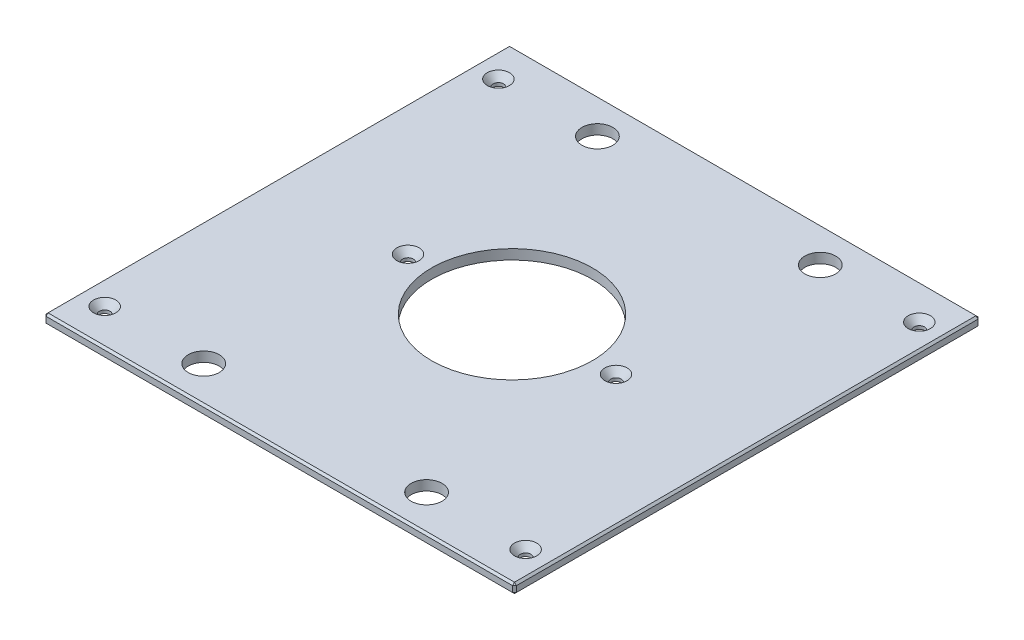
ISO-10303-21;
HEADER;
FILE_DESCRIPTION(('STEP AP214'),'2;1');
FILE_NAME('part.step','',(''),(''),'','','');
FILE_SCHEMA(('AUTOMOTIVE_DESIGN { 1 0 10303 214 1 1 1 1 }'));
ENDSEC;
DATA;
#1=APPLICATION_CONTEXT('core data for automotive mechanical design processes');
#2=APPLICATION_PROTOCOL_DEFINITION('international standard','automotive_design',2000,#1);
#3=PRODUCT_CONTEXT('',#1,'mechanical');
#4=PRODUCT('Part','Part','',(#3));
#5=PRODUCT_RELATED_PRODUCT_CATEGORY('part','',(#4));
#6=PRODUCT_DEFINITION_FORMATION('','',#4);
#7=PRODUCT_DEFINITION_CONTEXT('part definition',#1,'design');
#8=PRODUCT_DEFINITION('design','',#6,#7);
#9=PRODUCT_DEFINITION_SHAPE('','',#8);
#10=(LENGTH_UNIT() NAMED_UNIT(*) SI_UNIT(.MILLI.,.METRE.));
#11=(NAMED_UNIT(*) PLANE_ANGLE_UNIT() SI_UNIT($,.RADIAN.));
#12=(NAMED_UNIT(*) SI_UNIT($,.STERADIAN.) SOLID_ANGLE_UNIT());
#13=UNCERTAINTY_MEASURE_WITH_UNIT(LENGTH_MEASURE(1.E-05),#10,'distance_accuracy_value','');
#14=(GEOMETRIC_REPRESENTATION_CONTEXT(3) GLOBAL_UNCERTAINTY_ASSIGNED_CONTEXT((#13)) GLOBAL_UNIT_ASSIGNED_CONTEXT((#10,
#11,#12)) REPRESENTATION_CONTEXT('',''));
#15=CARTESIAN_POINT('',(0.,0.,0.));
#16=DIRECTION('',(0.,0.,1.));
#17=DIRECTION('',(1.,0.,0.));
#18=AXIS2_PLACEMENT_3D('',#15,#16,#17);
#19=CARTESIAN_POINT('',(-150.8125,6.35,-149.225));
#20=DIRECTION('',(1.,0.,0.));
#21=DIRECTION('',(0.,0.,-1.));
#22=AXIS2_PLACEMENT_3D('',#19,#20,#21);
#23=PLANE('',#22);
#24=DIRECTION('',(0.,0.,-1.));
#25=VECTOR('',#24,1.);
#26=CARTESIAN_POINT('',(-150.8125,5.08000000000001,-149.225));
#27=LINE('',#26,#25);
#28=CARTESIAN_POINT('',(-150.8125,5.08000000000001,147.955));
#29=VERTEX_POINT('',#28);
#30=CARTESIAN_POINT('',(-150.8125,5.08000000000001,-147.955));
#31=VERTEX_POINT('',#30);
#32=EDGE_CURVE('E135',#29,#31,#27,.T.);
#33=ORIENTED_EDGE('',*,*,#32,.T.);
#34=DIRECTION('',(0.,-1.,0.));
#35=VECTOR('',#34,1.);
#36=CARTESIAN_POINT('',(-150.8125,6.35,-147.955));
#37=LINE('',#36,#35);
#38=CARTESIAN_POINT('',(-150.8125,1.26999999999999,-147.955));
#39=VERTEX_POINT('',#38);
#40=EDGE_CURVE('E131',#31,#39,#37,.T.);
#41=ORIENTED_EDGE('',*,*,#40,.T.);
#42=DIRECTION('',(0.,0.,1.));
#43=VECTOR('',#42,1.);
#44=CARTESIAN_POINT('',(-150.8125,1.26999999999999,-149.225));
#45=LINE('',#44,#43);
#46=CARTESIAN_POINT('',(-150.8125,1.26999999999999,147.955));
#47=VERTEX_POINT('',#46);
#48=EDGE_CURVE('E126',#39,#47,#45,.T.);
#49=ORIENTED_EDGE('',*,*,#48,.T.);
#50=DIRECTION('',(0.,1.,0.));
#51=VECTOR('',#50,1.);
#52=CARTESIAN_POINT('',(-150.8125,6.35,147.955));
#53=LINE('',#52,#51);
#54=EDGE_CURVE('E128',#47,#29,#53,.T.);
#55=ORIENTED_EDGE('',*,*,#54,.T.);
#56=EDGE_LOOP('',(#33,#41,#49,#55));
#57=FACE_BOUND('',#56,.T.);
#58=ADVANCED_FACE('F35',(#57),#23,.F.);
#59=CARTESIAN_POINT('',(-150.8125,6.35,149.225));
#60=DIRECTION('',(0.,0.,-1.));
#61=DIRECTION('',(-1.,0.,0.));
#62=AXIS2_PLACEMENT_3D('',#59,#60,#61);
#63=PLANE('',#62);
#64=DIRECTION('',(1.,0.,0.));
#65=VECTOR('',#64,1.);
#66=CARTESIAN_POINT('',(-150.8125,1.26999999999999,149.225));
#67=LINE('',#66,#65);
#68=CARTESIAN_POINT('',(-149.5425,1.26999999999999,149.225));
#69=VERTEX_POINT('',#68);
#70=CARTESIAN_POINT('',(149.5425,1.26999999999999,149.225));
#71=VERTEX_POINT('',#70);
#72=EDGE_CURVE('E58',#69,#71,#67,.T.);
#73=ORIENTED_EDGE('',*,*,#72,.T.);
#74=DIRECTION('',(0.,1.,0.));
#75=VECTOR('',#74,1.);
#76=CARTESIAN_POINT('',(149.5425,6.35,149.225));
#77=LINE('',#76,#75);
#78=CARTESIAN_POINT('',(149.5425,5.08000000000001,149.225));
#79=VERTEX_POINT('',#78);
#80=EDGE_CURVE('E11',#71,#79,#77,.T.);
#81=ORIENTED_EDGE('',*,*,#80,.T.);
#82=DIRECTION('',(-1.,0.,0.));
#83=VECTOR('',#82,1.);
#84=CARTESIAN_POINT('',(-150.8125,5.08000000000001,149.225));
#85=LINE('',#84,#83);
#86=CARTESIAN_POINT('',(-149.5425,5.08000000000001,149.225));
#87=VERTEX_POINT('',#86);
#88=EDGE_CURVE('E44',#79,#87,#85,.T.);
#89=ORIENTED_EDGE('',*,*,#88,.T.);
#90=DIRECTION('',(0.,-1.,0.));
#91=VECTOR('',#90,1.);
#92=CARTESIAN_POINT('',(-149.5425,6.35,149.225));
#93=LINE('',#92,#91);
#94=EDGE_CURVE('E279',#87,#69,#93,.T.);
#95=ORIENTED_EDGE('',*,*,#94,.T.);
#96=EDGE_LOOP('',(#73,#81,#89,#95));
#97=FACE_BOUND('',#96,.T.);
#98=ADVANCED_FACE('F348',(#97),#63,.F.);
#99=CARTESIAN_POINT('',(150.8125,6.35,-149.225));
#100=DIRECTION('',(-1.,0.,0.));
#101=DIRECTION('',(0.,0.,1.));
#102=AXIS2_PLACEMENT_3D('',#99,#100,#101);
#103=PLANE('',#102);
#104=DIRECTION('',(0.,0.,-1.));
#105=VECTOR('',#104,1.);
#106=CARTESIAN_POINT('',(150.8125,1.26999999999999,-149.225));
#107=LINE('',#106,#105);
#108=CARTESIAN_POINT('',(150.8125,1.26999999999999,147.955));
#109=VERTEX_POINT('',#108);
#110=CARTESIAN_POINT('',(150.8125,1.26999999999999,-147.955));
#111=VERTEX_POINT('',#110);
#112=EDGE_CURVE('E274',#109,#111,#107,.T.);
#113=ORIENTED_EDGE('',*,*,#112,.T.);
#114=DIRECTION('',(0.,1.,0.));
#115=VECTOR('',#114,1.);
#116=CARTESIAN_POINT('',(150.8125,6.35,-147.955));
#117=LINE('',#116,#115);
#118=CARTESIAN_POINT('',(150.8125,5.08000000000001,-147.955));
#119=VERTEX_POINT('',#118);
#120=EDGE_CURVE('E276',#111,#119,#117,.T.);
#121=ORIENTED_EDGE('',*,*,#120,.T.);
#122=DIRECTION('',(0.,0.,1.));
#123=VECTOR('',#122,1.);
#124=CARTESIAN_POINT('',(150.8125,5.08000000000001,149.225));
#125=LINE('',#124,#123);
#126=CARTESIAN_POINT('',(150.8125,5.08000000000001,147.955));
#127=VERTEX_POINT('',#126);
#128=EDGE_CURVE('E272',#119,#127,#125,.T.);
#129=ORIENTED_EDGE('',*,*,#128,.T.);
#130=DIRECTION('',(0.,-1.,0.));
#131=VECTOR('',#130,1.);
#132=CARTESIAN_POINT('',(150.8125,6.35,147.955));
#133=LINE('',#132,#131);
#134=EDGE_CURVE('E270',#127,#109,#133,.T.);
#135=ORIENTED_EDGE('',*,*,#134,.T.);
#136=EDGE_LOOP('',(#113,#121,#129,#135));
#137=FACE_BOUND('',#136,.T.);
#138=ADVANCED_FACE('F335',(#137),#103,.F.);
#139=CARTESIAN_POINT('',(-150.8125,6.35,-149.225));
#140=DIRECTION('',(0.,0.,1.));
#141=DIRECTION('',(1.,0.,0.));
#142=AXIS2_PLACEMENT_3D('',#139,#140,#141);
#143=PLANE('',#142);
#144=DIRECTION('',(-1.,0.,0.));
#145=VECTOR('',#144,1.);
#146=CARTESIAN_POINT('',(-150.8125,1.26999999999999,-149.225));
#147=LINE('',#146,#145);
#148=CARTESIAN_POINT('',(149.5425,1.26999999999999,-149.225));
#149=VERTEX_POINT('',#148);
#150=CARTESIAN_POINT('',(-149.5425,1.26999999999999,-149.225));
#151=VERTEX_POINT('',#150);
#152=EDGE_CURVE('E246',#149,#151,#147,.T.);
#153=ORIENTED_EDGE('',*,*,#152,.T.);
#154=DIRECTION('',(0.,1.,0.));
#155=VECTOR('',#154,1.);
#156=CARTESIAN_POINT('',(-149.5425,6.35,-149.225));
#157=LINE('',#156,#155);
#158=CARTESIAN_POINT('',(-149.5425,5.08000000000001,-149.225));
#159=VERTEX_POINT('',#158);
#160=EDGE_CURVE('E250',#151,#159,#157,.T.);
#161=ORIENTED_EDGE('',*,*,#160,.T.);
#162=DIRECTION('',(1.,0.,0.));
#163=VECTOR('',#162,1.);
#164=CARTESIAN_POINT('',(150.8125,5.08000000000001,-149.225));
#165=LINE('',#164,#163);
#166=CARTESIAN_POINT('',(149.5425,5.08000000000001,-149.225));
#167=VERTEX_POINT('',#166);
#168=EDGE_CURVE('E248',#159,#167,#165,.T.);
#169=ORIENTED_EDGE('',*,*,#168,.T.);
#170=DIRECTION('',(0.,-1.,0.));
#171=VECTOR('',#170,1.);
#172=CARTESIAN_POINT('',(149.5425,6.35,-149.225));
#173=LINE('',#172,#171);
#174=EDGE_CURVE('E244',#167,#149,#173,.T.);
#175=ORIENTED_EDGE('',*,*,#174,.T.);
#176=EDGE_LOOP('',(#153,#161,#169,#175));
#177=FACE_BOUND('',#176,.T.);
#178=ADVANCED_FACE('F309',(#177),#143,.F.);
#179=CARTESIAN_POINT('',(0.,6.35,0.));
#180=DIRECTION('',(0.,1.,0.));
#181=DIRECTION('',(0.,0.,1.));
#182=AXIS2_PLACEMENT_3D('',#179,#180,#181);
#183=PLANE('',#182);
#184=CARTESIAN_POINT('',(134.9375,6.35,-126.20498));
#185=DIRECTION('',(0.,1.,0.));
#186=DIRECTION('',(0.,0.,1.));
#187=AXIS2_PLACEMENT_3D('',#184,#185,#186);
#188=CIRCLE('',#187,7.13739999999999);
#189=CARTESIAN_POINT('',(134.9375,6.35,-119.06758));
#190=VERTEX_POINT('',#189);
#191=EDGE_CURVE('E752',#190,#190,#188,.T.);
#192=ORIENTED_EDGE('',*,*,#191,.F.);
#193=EDGE_LOOP('',(#192));
#194=FACE_BOUND('',#193,.T.);
#195=CARTESIAN_POINT('',(134.9375,6.35,126.20498));
#196=DIRECTION('',(0.,1.,0.));
#197=DIRECTION('',(0.,0.,1.));
#198=AXIS2_PLACEMENT_3D('',#195,#196,#197);
#199=CIRCLE('',#198,7.13739999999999);
#200=CARTESIAN_POINT('',(134.9375,6.35,133.34238));
#201=VERTEX_POINT('',#200);
#202=EDGE_CURVE('E756',#201,#201,#199,.T.);
#203=ORIENTED_EDGE('',*,*,#202,.F.);
#204=EDGE_LOOP('',(#203));
#205=FACE_BOUND('',#204,.T.);
#206=CARTESIAN_POINT('',(-134.9375,6.35,126.20498));
#207=DIRECTION('',(0.,1.,0.));
#208=DIRECTION('',(0.,0.,1.));
#209=AXIS2_PLACEMENT_3D('',#206,#207,#208);
#210=CIRCLE('',#209,7.13739999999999);
#211=CARTESIAN_POINT('',(-134.9375,6.35,133.34238));
#212=VERTEX_POINT('',#211);
#213=EDGE_CURVE('E760',#212,#212,#210,.T.);
#214=ORIENTED_EDGE('',*,*,#213,.F.);
#215=EDGE_LOOP('',(#214));
#216=FACE_BOUND('',#215,.T.);
#217=CARTESIAN_POINT('',(-66.675,6.35,0.));
#218=DIRECTION('',(0.,1.,0.));
#219=DIRECTION('',(0.,0.,1.));
#220=AXIS2_PLACEMENT_3D('',#217,#218,#219);
#221=CIRCLE('',#220,7.1374);
#222=CARTESIAN_POINT('',(-66.675,6.35,7.1374));
#223=VERTEX_POINT('',#222);
#224=EDGE_CURVE('E764',#223,#223,#221,.T.);
#225=ORIENTED_EDGE('',*,*,#224,.F.);
#226=EDGE_LOOP('',(#225));
#227=FACE_BOUND('',#226,.T.);
#228=CARTESIAN_POINT('',(66.675,6.35,0.));
#229=DIRECTION('',(0.,1.,0.));
#230=DIRECTION('',(0.,0.,1.));
#231=AXIS2_PLACEMENT_3D('',#228,#229,#230);
#232=CIRCLE('',#231,7.1374);
#233=CARTESIAN_POINT('',(66.675,6.35,7.1374));
#234=VERTEX_POINT('',#233);
#235=EDGE_CURVE('E768',#234,#234,#232,.T.);
#236=ORIENTED_EDGE('',*,*,#235,.F.);
#237=EDGE_LOOP('',(#236));
#238=FACE_BOUND('',#237,.T.);
#239=CARTESIAN_POINT('',(-134.9375,6.35,-126.20498));
#240=DIRECTION('',(0.,1.,0.));
#241=DIRECTION('',(0.,0.,1.));
#242=AXIS2_PLACEMENT_3D('',#239,#240,#241);
#243=CIRCLE('',#242,7.13739999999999);
#244=CARTESIAN_POINT('',(-134.9375,6.35,-119.06758));
#245=VERTEX_POINT('',#244);
#246=EDGE_CURVE('E771',#245,#245,#243,.T.);
#247=ORIENTED_EDGE('',*,*,#246,.F.);
#248=EDGE_LOOP('',(#247));
#249=FACE_BOUND('',#248,.T.);
#250=DIRECTION('',(0.,0.,-1.));
#251=VECTOR('',#250,1.);
#252=CARTESIAN_POINT('',(149.5425,6.35,-149.225));
#253=LINE('',#252,#251);
#254=CARTESIAN_POINT('',(149.5425,6.35,147.955));
#255=VERTEX_POINT('',#254);
#256=CARTESIAN_POINT('',(149.5425,6.35,-147.955));
#257=VERTEX_POINT('',#256);
#258=EDGE_CURVE('E257',#255,#257,#253,.T.);
#259=ORIENTED_EDGE('',*,*,#258,.T.);
#260=DIRECTION('',(-1.,0.,0.));
#261=VECTOR('',#260,1.);
#262=CARTESIAN_POINT('',(-150.8125,6.35,-147.955));
#263=LINE('',#262,#261);
#264=CARTESIAN_POINT('',(-149.5425,6.35,-147.955));
#265=VERTEX_POINT('',#264);
#266=EDGE_CURVE('E259',#257,#265,#263,.T.);
#267=ORIENTED_EDGE('',*,*,#266,.T.);
#268=DIRECTION('',(0.,0.,1.));
#269=VECTOR('',#268,1.);
#270=CARTESIAN_POINT('',(-149.5425,6.35,149.225));
#271=LINE('',#270,#269);
#272=CARTESIAN_POINT('',(-149.5425,6.35,147.955));
#273=VERTEX_POINT('',#272);
#274=EDGE_CURVE('E255',#265,#273,#271,.T.);
#275=ORIENTED_EDGE('',*,*,#274,.T.);
#276=DIRECTION('',(1.,0.,0.));
#277=VECTOR('',#276,1.);
#278=CARTESIAN_POINT('',(150.8125,6.35,147.955));
#279=LINE('',#278,#277);
#280=EDGE_CURVE('E253',#273,#255,#279,.T.);
#281=ORIENTED_EDGE('',*,*,#280,.T.);
#282=EDGE_LOOP('',(#259,#267,#275,#281));
#283=FACE_BOUND('',#282,.T.);
#284=CARTESIAN_POINT('',(71.4375,6.35,-126.20498));
#285=DIRECTION('',(0.,1.,0.));
#286=DIRECTION('',(0.,0.,1.));
#287=AXIS2_PLACEMENT_3D('',#284,#285,#286);
#288=CIRCLE('',#287,9.921875);
#289=CARTESIAN_POINT('',(71.4375,6.35,-116.283105));
#290=VERTEX_POINT('',#289);
#291=EDGE_CURVE('E204',#290,#290,#288,.T.);
#292=ORIENTED_EDGE('',*,*,#291,.F.);
#293=EDGE_LOOP('',(#292));
#294=FACE_BOUND('',#293,.T.);
#295=CARTESIAN_POINT('',(-71.4375,6.35,-126.20498));
#296=DIRECTION('',(0.,1.,0.));
#297=DIRECTION('',(0.,0.,1.));
#298=AXIS2_PLACEMENT_3D('',#295,#296,#297);
#299=CIRCLE('',#298,9.921875);
#300=CARTESIAN_POINT('',(-71.4375,6.35,-116.283105));
#301=VERTEX_POINT('',#300);
#302=EDGE_CURVE('E214',#301,#301,#299,.T.);
#303=ORIENTED_EDGE('',*,*,#302,.F.);
#304=EDGE_LOOP('',(#303));
#305=FACE_BOUND('',#304,.T.);
#306=CARTESIAN_POINT('',(71.4375,6.35,126.20498));
#307=DIRECTION('',(0.,1.,0.));
#308=DIRECTION('',(0.,0.,1.));
#309=AXIS2_PLACEMENT_3D('',#306,#307,#308);
#310=CIRCLE('',#309,9.921875);
#311=CARTESIAN_POINT('',(71.4375,6.35,136.126855));
#312=VERTEX_POINT('',#311);
#313=EDGE_CURVE('E225',#312,#312,#310,.T.);
#314=ORIENTED_EDGE('',*,*,#313,.F.);
#315=EDGE_LOOP('',(#314));
#316=FACE_BOUND('',#315,.T.);
#317=CARTESIAN_POINT('',(-71.4375,6.35,126.20498));
#318=DIRECTION('',(0.,1.,0.));
#319=DIRECTION('',(0.,0.,1.));
#320=AXIS2_PLACEMENT_3D('',#317,#318,#319);
#321=CIRCLE('',#320,9.921875);
#322=CARTESIAN_POINT('',(-71.4375,6.35,136.126855));
#323=VERTEX_POINT('',#322);
#324=EDGE_CURVE('E231',#323,#323,#321,.T.);
#325=ORIENTED_EDGE('',*,*,#324,.F.);
#326=EDGE_LOOP('',(#325));
#327=FACE_BOUND('',#326,.T.);
#328=CARTESIAN_POINT('',(0.,6.35,0.));
#329=DIRECTION('',(0.,1.,0.));
#330=DIRECTION('',(0.,0.,1.));
#331=AXIS2_PLACEMENT_3D('',#328,#329,#330);
#332=CIRCLE('',#331,51.562);
#333=CARTESIAN_POINT('',(0.,6.35,51.562));
#334=VERTEX_POINT('',#333);
#335=EDGE_CURVE('E237',#334,#334,#332,.T.);
#336=ORIENTED_EDGE('',*,*,#335,.F.);
#337=EDGE_LOOP('',(#336));
#338=FACE_BOUND('',#337,.T.);
#339=ADVANCED_FACE('F357',(#194,#205,#216,#227,#238,#249,#283,#294,#305,#316,#327,#338),#183,.T.);
#340=CARTESIAN_POINT('',(0.,0.,0.));
#341=DIRECTION('',(0.,1.,0.));
#342=DIRECTION('',(0.,0.,1.));
#343=AXIS2_PLACEMENT_3D('',#340,#341,#342);
#344=PLANE('',#343);
#345=CARTESIAN_POINT('',(134.9375,0.,-126.20498));
#346=DIRECTION('',(0.,1.,0.));
#347=DIRECTION('',(0.,0.,1.));
#348=AXIS2_PLACEMENT_3D('',#345,#346,#347);
#349=CIRCLE('',#348,3.3782);
#350=CARTESIAN_POINT('',(134.9375,0.,-122.82678));
#351=VERTEX_POINT('',#350);
#352=EDGE_CURVE('E805',#351,#351,#349,.T.);
#353=ORIENTED_EDGE('',*,*,#352,.T.);
#354=EDGE_LOOP('',(#353));
#355=FACE_BOUND('',#354,.T.);
#356=CARTESIAN_POINT('',(134.9375,0.,126.20498));
#357=DIRECTION('',(0.,1.,0.));
#358=DIRECTION('',(0.,0.,1.));
#359=AXIS2_PLACEMENT_3D('',#356,#357,#358);
#360=CIRCLE('',#359,3.3782);
#361=CARTESIAN_POINT('',(134.9375,0.,129.58318));
#362=VERTEX_POINT('',#361);
#363=EDGE_CURVE('E798',#362,#362,#360,.T.);
#364=ORIENTED_EDGE('',*,*,#363,.T.);
#365=EDGE_LOOP('',(#364));
#366=FACE_BOUND('',#365,.T.);
#367=CARTESIAN_POINT('',(-134.9375,0.,126.20498));
#368=DIRECTION('',(0.,1.,0.));
#369=DIRECTION('',(0.,0.,1.));
#370=AXIS2_PLACEMENT_3D('',#367,#368,#369);
#371=CIRCLE('',#370,3.3782);
#372=CARTESIAN_POINT('',(-134.9375,0.,129.58318));
#373=VERTEX_POINT('',#372);
#374=EDGE_CURVE('E791',#373,#373,#371,.T.);
#375=ORIENTED_EDGE('',*,*,#374,.T.);
#376=EDGE_LOOP('',(#375));
#377=FACE_BOUND('',#376,.T.);
#378=CARTESIAN_POINT('',(-66.675,0.,0.));
#379=DIRECTION('',(0.,1.,0.));
#380=DIRECTION('',(0.,0.,1.));
#381=AXIS2_PLACEMENT_3D('',#378,#379,#380);
#382=CIRCLE('',#381,3.3782);
#383=CARTESIAN_POINT('',(-66.675,0.,3.3782));
#384=VERTEX_POINT('',#383);
#385=EDGE_CURVE('E784',#384,#384,#382,.T.);
#386=ORIENTED_EDGE('',*,*,#385,.T.);
#387=EDGE_LOOP('',(#386));
#388=FACE_BOUND('',#387,.T.);
#389=CARTESIAN_POINT('',(66.675,0.,0.));
#390=DIRECTION('',(0.,1.,0.));
#391=DIRECTION('',(0.,0.,1.));
#392=AXIS2_PLACEMENT_3D('',#389,#390,#391);
#393=CIRCLE('',#392,3.3782);
#394=CARTESIAN_POINT('',(66.675,0.,3.3782));
#395=VERTEX_POINT('',#394);
#396=EDGE_CURVE('E774',#395,#395,#393,.T.);
#397=ORIENTED_EDGE('',*,*,#396,.T.);
#398=EDGE_LOOP('',(#397));
#399=FACE_BOUND('',#398,.T.);
#400=CARTESIAN_POINT('',(-134.9375,0.,-126.20498));
#401=DIRECTION('',(0.,1.,0.));
#402=DIRECTION('',(0.,0.,1.));
#403=AXIS2_PLACEMENT_3D('',#400,#401,#402);
#404=CIRCLE('',#403,3.3782);
#405=CARTESIAN_POINT('',(-134.9375,0.,-122.82678));
#406=VERTEX_POINT('',#405);
#407=EDGE_CURVE('E217',#406,#406,#404,.T.);
#408=ORIENTED_EDGE('',*,*,#407,.T.);
#409=EDGE_LOOP('',(#408));
#410=FACE_BOUND('',#409,.T.);
#411=DIRECTION('',(0.,0.,-1.));
#412=VECTOR('',#411,1.);
#413=CARTESIAN_POINT('',(-149.5425,0.,0.));
#414=LINE('',#413,#412);
#415=CARTESIAN_POINT('',(-149.5425,0.,147.955));
#416=VERTEX_POINT('',#415);
#417=CARTESIAN_POINT('',(-149.5425,0.,-147.955));
#418=VERTEX_POINT('',#417);
#419=EDGE_CURVE('E158',#416,#418,#414,.T.);
#420=ORIENTED_EDGE('',*,*,#419,.T.);
#421=DIRECTION('',(1.,0.,0.));
#422=VECTOR('',#421,1.);
#423=CARTESIAN_POINT('',(0.,0.,-147.955));
#424=LINE('',#423,#422);
#425=CARTESIAN_POINT('',(149.5425,0.,-147.955));
#426=VERTEX_POINT('',#425);
#427=EDGE_CURVE('E267',#418,#426,#424,.T.);
#428=ORIENTED_EDGE('',*,*,#427,.T.);
#429=DIRECTION('',(0.,0.,1.));
#430=VECTOR('',#429,1.);
#431=CARTESIAN_POINT('',(149.5425,0.,0.));
#432=LINE('',#431,#430);
#433=CARTESIAN_POINT('',(149.5425,0.,147.955));
#434=VERTEX_POINT('',#433);
#435=EDGE_CURVE('E265',#426,#434,#432,.T.);
#436=ORIENTED_EDGE('',*,*,#435,.T.);
#437=DIRECTION('',(-1.,0.,0.));
#438=VECTOR('',#437,1.);
#439=CARTESIAN_POINT('',(0.,0.,147.955));
#440=LINE('',#439,#438);
#441=EDGE_CURVE('E262',#434,#416,#440,.T.);
#442=ORIENTED_EDGE('',*,*,#441,.T.);
#443=EDGE_LOOP('',(#420,#428,#436,#442));
#444=FACE_BOUND('',#443,.T.);
#445=CARTESIAN_POINT('',(71.4375,0.,-126.20498));
#446=DIRECTION('',(0.,1.,0.));
#447=DIRECTION('',(0.,0.,1.));
#448=AXIS2_PLACEMENT_3D('',#445,#446,#447);
#449=CIRCLE('',#448,9.921875);
#450=CARTESIAN_POINT('',(71.4375,0.,-116.283105));
#451=VERTEX_POINT('',#450);
#452=EDGE_CURVE('E209',#451,#451,#449,.T.);
#453=ORIENTED_EDGE('',*,*,#452,.T.);
#454=EDGE_LOOP('',(#453));
#455=FACE_BOUND('',#454,.T.);
#456=CARTESIAN_POINT('',(-71.4375,0.,-126.20498));
#457=DIRECTION('',(0.,1.,0.));
#458=DIRECTION('',(0.,0.,1.));
#459=AXIS2_PLACEMENT_3D('',#456,#457,#458);
#460=CIRCLE('',#459,9.921875);
#461=CARTESIAN_POINT('',(-71.4375,0.,-116.283105));
#462=VERTEX_POINT('',#461);
#463=EDGE_CURVE('E222',#462,#462,#460,.T.);
#464=ORIENTED_EDGE('',*,*,#463,.T.);
#465=EDGE_LOOP('',(#464));
#466=FACE_BOUND('',#465,.T.);
#467=CARTESIAN_POINT('',(71.4375,0.,126.20498));
#468=DIRECTION('',(0.,1.,0.));
#469=DIRECTION('',(0.,0.,1.));
#470=AXIS2_PLACEMENT_3D('',#467,#468,#469);
#471=CIRCLE('',#470,9.921875);
#472=CARTESIAN_POINT('',(71.4375,0.,136.126855));
#473=VERTEX_POINT('',#472);
#474=EDGE_CURVE('E228',#473,#473,#471,.T.);
#475=ORIENTED_EDGE('',*,*,#474,.T.);
#476=EDGE_LOOP('',(#475));
#477=FACE_BOUND('',#476,.T.);
#478=CARTESIAN_POINT('',(-71.4375,0.,126.20498));
#479=DIRECTION('',(0.,1.,0.));
#480=DIRECTION('',(0.,0.,1.));
#481=AXIS2_PLACEMENT_3D('',#478,#479,#480);
#482=CIRCLE('',#481,9.921875);
#483=CARTESIAN_POINT('',(-71.4375,0.,136.126855));
#484=VERTEX_POINT('',#483);
#485=EDGE_CURVE('E234',#484,#484,#482,.T.);
#486=ORIENTED_EDGE('',*,*,#485,.T.);
#487=EDGE_LOOP('',(#486));
#488=FACE_BOUND('',#487,.T.);
#489=CARTESIAN_POINT('',(0.,0.,0.));
#490=DIRECTION('',(0.,1.,0.));
#491=DIRECTION('',(0.,0.,1.));
#492=AXIS2_PLACEMENT_3D('',#489,#490,#491);
#493=CIRCLE('',#492,51.562);
#494=CARTESIAN_POINT('',(0.,0.,51.562));
#495=VERTEX_POINT('',#494);
#496=EDGE_CURVE('E147',#495,#495,#493,.T.);
#497=ORIENTED_EDGE('',*,*,#496,.T.);
#498=EDGE_LOOP('',(#497));
#499=FACE_BOUND('',#498,.T.);
#500=ADVANCED_FACE('F322',(#355,#366,#377,#388,#399,#410,#444,#455,#466,#477,#488,#499),#344,.F.);
#501=CARTESIAN_POINT('',(0.,0.,0.));
#502=DIRECTION('',(0.,1.,0.));
#503=DIRECTION('',(0.,0.,1.));
#504=AXIS2_PLACEMENT_3D('',#501,#502,#503);
#505=CYLINDRICAL_SURFACE('',#504,51.562);
#506=ORIENTED_EDGE('',*,*,#496,.F.);
#507=EDGE_LOOP('',(#506));
#508=FACE_BOUND('',#507,.T.);
#509=ORIENTED_EDGE('',*,*,#335,.T.);
#510=EDGE_LOOP('',(#509));
#511=FACE_BOUND('',#510,.T.);
#512=ADVANCED_FACE('F691',(#508,#511),#505,.F.);
#513=CARTESIAN_POINT('',(-71.4375,6.35,126.20498));
#514=DIRECTION('',(0.,1.,0.));
#515=DIRECTION('',(0.,0.,1.));
#516=AXIS2_PLACEMENT_3D('',#513,#514,#515);
#517=CYLINDRICAL_SURFACE('',#516,9.921875);
#518=ORIENTED_EDGE('',*,*,#485,.F.);
#519=EDGE_LOOP('',(#518));
#520=FACE_BOUND('',#519,.T.);
#521=ORIENTED_EDGE('',*,*,#324,.T.);
#522=EDGE_LOOP('',(#521));
#523=FACE_BOUND('',#522,.T.);
#524=ADVANCED_FACE('F682',(#520,#523),#517,.F.);
#525=CARTESIAN_POINT('',(71.4375,6.35,126.20498));
#526=DIRECTION('',(0.,1.,0.));
#527=DIRECTION('',(0.,0.,1.));
#528=AXIS2_PLACEMENT_3D('',#525,#526,#527);
#529=CYLINDRICAL_SURFACE('',#528,9.921875);
#530=ORIENTED_EDGE('',*,*,#474,.F.);
#531=EDGE_LOOP('',(#530));
#532=FACE_BOUND('',#531,.T.);
#533=ORIENTED_EDGE('',*,*,#313,.T.);
#534=EDGE_LOOP('',(#533));
#535=FACE_BOUND('',#534,.T.);
#536=ADVANCED_FACE('F673',(#532,#535),#529,.F.);
#537=CARTESIAN_POINT('',(-71.4375,6.35,-126.20498));
#538=DIRECTION('',(0.,1.,0.));
#539=DIRECTION('',(0.,0.,1.));
#540=AXIS2_PLACEMENT_3D('',#537,#538,#539);
#541=CYLINDRICAL_SURFACE('',#540,9.921875);
#542=ORIENTED_EDGE('',*,*,#463,.F.);
#543=EDGE_LOOP('',(#542));
#544=FACE_BOUND('',#543,.T.);
#545=ORIENTED_EDGE('',*,*,#302,.T.);
#546=EDGE_LOOP('',(#545));
#547=FACE_BOUND('',#546,.T.);
#548=ADVANCED_FACE('F663',(#544,#547),#541,.F.);
#549=CARTESIAN_POINT('',(71.4375,6.35,-126.20498));
#550=DIRECTION('',(0.,1.,0.));
#551=DIRECTION('',(0.,0.,1.));
#552=AXIS2_PLACEMENT_3D('',#549,#550,#551);
#553=CYLINDRICAL_SURFACE('',#552,9.921875);
#554=ORIENTED_EDGE('',*,*,#452,.F.);
#555=EDGE_LOOP('',(#554));
#556=FACE_BOUND('',#555,.T.);
#557=ORIENTED_EDGE('',*,*,#291,.T.);
#558=EDGE_LOOP('',(#557));
#559=FACE_BOUND('',#558,.T.);
#560=ADVANCED_FACE('F366',(#556,#559),#553,.F.);
#561=CARTESIAN_POINT('',(150.8125,6.35,147.955));
#562=DIRECTION('',(-0.707106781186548,0.,-0.707106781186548));
#563=DIRECTION('',(0.,-1.,0.));
#564=AXIS2_PLACEMENT_3D('',#561,#562,#563);
#565=PLANE('',#564);
#566=DIRECTION('',(-0.707106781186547,0.,0.707106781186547));
#567=VECTOR('',#566,1.);
#568=CARTESIAN_POINT('',(150.8125,5.08000000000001,147.955));
#569=LINE('',#568,#567);
#570=EDGE_CURVE('E39',#79,#127,#569,.F.);
#571=ORIENTED_EDGE('',*,*,#570,.F.);
#572=ORIENTED_EDGE('',*,*,#80,.F.);
#573=DIRECTION('',(0.707106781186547,0.,-0.707106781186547));
#574=VECTOR('',#573,1.);
#575=CARTESIAN_POINT('',(150.1775,1.26999999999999,148.59));
#576=LINE('',#575,#574);
#577=EDGE_CURVE('E197',#109,#71,#576,.F.);
#578=ORIENTED_EDGE('',*,*,#577,.F.);
#579=ORIENTED_EDGE('',*,*,#134,.F.);
#580=EDGE_LOOP('',(#571,#572,#578,#579));
#581=FACE_BOUND('',#580,.T.);
#582=ADVANCED_FACE('F37',(#581),#565,.F.);
#583=CARTESIAN_POINT('',(150.8125,5.08000000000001,147.955));
#584=DIRECTION('',(0.577350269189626,0.577350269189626,0.577350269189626));
#585=DIRECTION('',(0.707106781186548,0.,-0.707106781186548));
#586=AXIS2_PLACEMENT_3D('',#583,#584,#585);
#587=PLANE('',#586);
#588=DIRECTION('',(0.,-0.707106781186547,0.707106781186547));
#589=VECTOR('',#588,1.);
#590=CARTESIAN_POINT('',(149.5425,5.715,148.59));
#591=LINE('',#590,#589);
#592=EDGE_CURVE('E193',#79,#255,#591,.F.);
#593=ORIENTED_EDGE('',*,*,#592,.F.);
#594=ORIENTED_EDGE('',*,*,#570,.T.);
#595=DIRECTION('',(-0.707106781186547,0.707106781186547,0.));
#596=VECTOR('',#595,1.);
#597=CARTESIAN_POINT('',(150.8125,5.08000000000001,147.955));
#598=LINE('',#597,#596);
#599=EDGE_CURVE('E195',#255,#127,#598,.F.);
#600=ORIENTED_EDGE('',*,*,#599,.F.);
#601=EDGE_LOOP('',(#593,#594,#600));
#602=FACE_BOUND('',#601,.T.);
#603=ADVANCED_FACE('F359',(#602),#587,.T.);
#604=CARTESIAN_POINT('',(149.5425,0.,147.955));
#605=DIRECTION('',(0.577350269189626,-0.577350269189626,0.577350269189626));
#606=DIRECTION('',(0.707106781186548,0.,-0.707106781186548));
#607=AXIS2_PLACEMENT_3D('',#604,#605,#606);
#608=PLANE('',#607);
#609=DIRECTION('',(-0.707106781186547,-0.707106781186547,0.));
#610=VECTOR('',#609,1.);
#611=CARTESIAN_POINT('',(149.5425,0.,147.955));
#612=LINE('',#611,#610);
#613=EDGE_CURVE('E187',#109,#434,#612,.T.);
#614=ORIENTED_EDGE('',*,*,#613,.F.);
#615=ORIENTED_EDGE('',*,*,#577,.T.);
#616=DIRECTION('',(0.,0.707106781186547,0.707106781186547));
#617=VECTOR('',#616,1.);
#618=CARTESIAN_POINT('',(149.5425,0.,147.955));
#619=LINE('',#618,#617);
#620=EDGE_CURVE('E190',#434,#71,#619,.T.);
#621=ORIENTED_EDGE('',*,*,#620,.F.);
#622=EDGE_LOOP('',(#614,#615,#621));
#623=FACE_BOUND('',#622,.T.);
#624=ADVANCED_FACE('F328',(#623),#608,.T.);
#625=CARTESIAN_POINT('',(149.5425,6.35,0.));
#626=DIRECTION('',(0.707106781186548,0.707106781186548,0.));
#627=DIRECTION('',(0.,0.,1.));
#628=AXIS2_PLACEMENT_3D('',#625,#626,#627);
#629=PLANE('',#628);
#630=ORIENTED_EDGE('',*,*,#599,.T.);
#631=ORIENTED_EDGE('',*,*,#128,.F.);
#632=DIRECTION('',(0.707106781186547,-0.707106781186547,0.));
#633=VECTOR('',#632,1.);
#634=CARTESIAN_POINT('',(150.1775,5.715,-147.955));
#635=LINE('',#634,#633);
#636=EDGE_CURVE('E182',#257,#119,#635,.T.);
#637=ORIENTED_EDGE('',*,*,#636,.F.);
#638=ORIENTED_EDGE('',*,*,#258,.F.);
#639=EDGE_LOOP('',(#630,#631,#637,#638));
#640=FACE_BOUND('',#639,.T.);
#641=ADVANCED_FACE('F345',(#640),#629,.T.);
#642=CARTESIAN_POINT('',(0.,6.35,147.955));
#643=DIRECTION('',(0.,0.707106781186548,0.707106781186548));
#644=DIRECTION('',(-1.,0.,0.));
#645=AXIS2_PLACEMENT_3D('',#642,#643,#644);
#646=PLANE('',#645);
#647=ORIENTED_EDGE('',*,*,#592,.T.);
#648=ORIENTED_EDGE('',*,*,#280,.F.);
#649=DIRECTION('',(0.,0.707106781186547,-0.707106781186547));
#650=VECTOR('',#649,1.);
#651=CARTESIAN_POINT('',(-149.5425,6.35,147.955));
#652=LINE('',#651,#650);
#653=EDGE_CURVE('E179',#87,#273,#652,.T.);
#654=ORIENTED_EDGE('',*,*,#653,.F.);
#655=ORIENTED_EDGE('',*,*,#88,.F.);
#656=EDGE_LOOP('',(#647,#648,#654,#655));
#657=FACE_BOUND('',#656,.T.);
#658=ADVANCED_FACE('F350',(#657),#646,.T.);
#659=CARTESIAN_POINT('',(-149.5425,6.35,149.225));
#660=DIRECTION('',(0.707106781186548,0.,-0.707106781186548));
#661=DIRECTION('',(0.,-1.,0.));
#662=AXIS2_PLACEMENT_3D('',#659,#660,#661);
#663=PLANE('',#662);
#664=DIRECTION('',(0.707106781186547,0.,0.707106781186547));
#665=VECTOR('',#664,1.);
#666=CARTESIAN_POINT('',(-150.8125,1.26999999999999,147.955));
#667=LINE('',#666,#665);
#668=EDGE_CURVE('E142',#69,#47,#667,.F.);
#669=ORIENTED_EDGE('',*,*,#668,.F.);
#670=ORIENTED_EDGE('',*,*,#94,.F.);
#671=DIRECTION('',(-0.707106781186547,0.,-0.707106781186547));
#672=VECTOR('',#671,1.);
#673=CARTESIAN_POINT('',(-150.1775,5.08000000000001,148.59));
#674=LINE('',#673,#672);
#675=EDGE_CURVE('E145',#29,#87,#674,.F.);
#676=ORIENTED_EDGE('',*,*,#675,.F.);
#677=ORIENTED_EDGE('',*,*,#54,.F.);
#678=EDGE_LOOP('',(#669,#670,#676,#677));
#679=FACE_BOUND('',#678,.T.);
#680=ADVANCED_FACE('F140',(#679),#663,.F.);
#681=CARTESIAN_POINT('',(-150.8125,1.26999999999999,149.225));
#682=DIRECTION('',(0.,0.707106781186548,-0.707106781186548));
#683=DIRECTION('',(1.,0.,0.));
#684=AXIS2_PLACEMENT_3D('',#681,#682,#683);
#685=PLANE('',#684);
#686=ORIENTED_EDGE('',*,*,#620,.T.);
#687=ORIENTED_EDGE('',*,*,#72,.F.);
#688=DIRECTION('',(0.,-0.707106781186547,-0.707106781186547));
#689=VECTOR('',#688,1.);
#690=CARTESIAN_POINT('',(-149.5425,0.634999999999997,148.59));
#691=LINE('',#690,#689);
#692=EDGE_CURVE('E155',#416,#69,#691,.F.);
#693=ORIENTED_EDGE('',*,*,#692,.F.);
#694=ORIENTED_EDGE('',*,*,#441,.F.);
#695=EDGE_LOOP('',(#686,#687,#693,#694));
#696=FACE_BOUND('',#695,.T.);
#697=ADVANCED_FACE('F327',(#696),#685,.F.);
#698=CARTESIAN_POINT('',(150.8125,1.26999999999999,-149.225));
#699=DIRECTION('',(-0.707106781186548,0.707106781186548,0.));
#700=DIRECTION('',(0.,0.,-1.));
#701=AXIS2_PLACEMENT_3D('',#698,#699,#700);
#702=PLANE('',#701);
#703=ORIENTED_EDGE('',*,*,#613,.T.);
#704=ORIENTED_EDGE('',*,*,#435,.F.);
#705=DIRECTION('',(0.707106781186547,0.707106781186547,0.));
#706=VECTOR('',#705,1.);
#707=CARTESIAN_POINT('',(149.5425,0.,-147.955));
#708=LINE('',#707,#706);
#709=EDGE_CURVE('E174',#111,#426,#708,.F.);
#710=ORIENTED_EDGE('',*,*,#709,.F.);
#711=ORIENTED_EDGE('',*,*,#112,.F.);
#712=EDGE_LOOP('',(#703,#704,#710,#711));
#713=FACE_BOUND('',#712,.T.);
#714=ADVANCED_FACE('F332',(#713),#702,.F.);
#715=CARTESIAN_POINT('',(149.5425,6.35,-149.225));
#716=DIRECTION('',(-0.707106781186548,0.,0.707106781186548));
#717=DIRECTION('',(0.,-1.,0.));
#718=AXIS2_PLACEMENT_3D('',#715,#716,#717);
#719=PLANE('',#718);
#720=DIRECTION('',(0.707106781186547,0.,0.707106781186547));
#721=VECTOR('',#720,1.);
#722=CARTESIAN_POINT('',(149.5425,5.08000000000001,-149.225));
#723=LINE('',#722,#721);
#724=EDGE_CURVE('E184',#119,#167,#723,.F.);
#725=ORIENTED_EDGE('',*,*,#724,.F.);
#726=ORIENTED_EDGE('',*,*,#120,.F.);
#727=DIRECTION('',(-0.707106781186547,0.,-0.707106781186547));
#728=VECTOR('',#727,1.);
#729=CARTESIAN_POINT('',(150.1775,1.26999999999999,-148.59));
#730=LINE('',#729,#728);
#731=EDGE_CURVE('E171',#149,#111,#730,.F.);
#732=ORIENTED_EDGE('',*,*,#731,.F.);
#733=ORIENTED_EDGE('',*,*,#174,.F.);
#734=EDGE_LOOP('',(#725,#726,#732,#733));
#735=FACE_BOUND('',#734,.T.);
#736=ADVANCED_FACE('F340',(#735),#719,.F.);
#737=CARTESIAN_POINT('',(149.5425,5.08000000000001,-149.225));
#738=DIRECTION('',(0.577350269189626,0.577350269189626,-0.577350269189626));
#739=DIRECTION('',(-0.707106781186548,0.,-0.707106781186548));
#740=AXIS2_PLACEMENT_3D('',#737,#738,#739);
#741=PLANE('',#740);
#742=ORIENTED_EDGE('',*,*,#636,.T.);
#743=ORIENTED_EDGE('',*,*,#724,.T.);
#744=DIRECTION('',(0.,0.707106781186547,0.707106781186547));
#745=VECTOR('',#744,1.);
#746=CARTESIAN_POINT('',(149.5425,5.08000000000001,-149.225));
#747=LINE('',#746,#745);
#748=EDGE_CURVE('E163',#257,#167,#747,.F.);
#749=ORIENTED_EDGE('',*,*,#748,.F.);
#750=EDGE_LOOP('',(#742,#743,#749));
#751=FACE_BOUND('',#750,.T.);
#752=ADVANCED_FACE('F398',(#751),#741,.T.);
#753=CARTESIAN_POINT('',(-149.5425,6.35,147.955));
#754=DIRECTION('',(-0.577350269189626,0.577350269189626,0.577350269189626));
#755=DIRECTION('',(0.707106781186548,0.,0.707106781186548));
#756=AXIS2_PLACEMENT_3D('',#753,#754,#755);
#757=PLANE('',#756);
#758=ORIENTED_EDGE('',*,*,#675,.T.);
#759=ORIENTED_EDGE('',*,*,#653,.T.);
#760=DIRECTION('',(-0.707106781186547,-0.707106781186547,0.));
#761=VECTOR('',#760,1.);
#762=CARTESIAN_POINT('',(-149.5425,6.35,147.955));
#763=LINE('',#762,#761);
#764=EDGE_CURVE('E159',#29,#273,#763,.F.);
#765=ORIENTED_EDGE('',*,*,#764,.F.);
#766=EDGE_LOOP('',(#758,#759,#765));
#767=FACE_BOUND('',#766,.T.);
#768=ADVANCED_FACE('F352',(#767),#757,.T.);
#769=CARTESIAN_POINT('',(-150.8125,1.26999999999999,147.955));
#770=DIRECTION('',(-0.577350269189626,-0.577350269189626,0.577350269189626));
#771=DIRECTION('',(0.707106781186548,0.,0.707106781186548));
#772=AXIS2_PLACEMENT_3D('',#769,#770,#771);
#773=PLANE('',#772);
#774=ORIENTED_EDGE('',*,*,#692,.T.);
#775=ORIENTED_EDGE('',*,*,#668,.T.);
#776=DIRECTION('',(-0.707106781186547,0.707106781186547,0.));
#777=VECTOR('',#776,1.);
#778=CARTESIAN_POINT('',(-150.8125,1.26999999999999,147.955));
#779=LINE('',#778,#777);
#780=EDGE_CURVE('E152',#416,#47,#779,.T.);
#781=ORIENTED_EDGE('',*,*,#780,.F.);
#782=EDGE_LOOP('',(#774,#775,#781));
#783=FACE_BOUND('',#782,.T.);
#784=ADVANCED_FACE('F151',(#783),#773,.T.);
#785=CARTESIAN_POINT('',(149.5425,0.,-147.955));
#786=DIRECTION('',(0.577350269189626,-0.577350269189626,-0.577350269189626));
#787=DIRECTION('',(-0.707106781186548,0.,-0.707106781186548));
#788=AXIS2_PLACEMENT_3D('',#785,#786,#787);
#789=PLANE('',#788);
#790=ORIENTED_EDGE('',*,*,#731,.T.);
#791=ORIENTED_EDGE('',*,*,#709,.T.);
#792=DIRECTION('',(0.,-0.707106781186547,0.707106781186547));
#793=VECTOR('',#792,1.);
#794=CARTESIAN_POINT('',(149.5425,0.,-147.955));
#795=LINE('',#794,#793);
#796=EDGE_CURVE('E160',#149,#426,#795,.T.);
#797=ORIENTED_EDGE('',*,*,#796,.F.);
#798=EDGE_LOOP('',(#790,#791,#797));
#799=FACE_BOUND('',#798,.T.);
#800=ADVANCED_FACE('F390',(#799),#789,.T.);
#801=CARTESIAN_POINT('',(0.,6.35,-147.955));
#802=DIRECTION('',(0.,0.707106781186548,-0.707106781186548));
#803=DIRECTION('',(1.,0.,0.));
#804=AXIS2_PLACEMENT_3D('',#801,#802,#803);
#805=PLANE('',#804);
#806=ORIENTED_EDGE('',*,*,#748,.T.);
#807=ORIENTED_EDGE('',*,*,#168,.F.);
#808=DIRECTION('',(0.,-0.707106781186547,-0.707106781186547));
#809=VECTOR('',#808,1.);
#810=CARTESIAN_POINT('',(-149.5425,5.08000000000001,-149.225));
#811=LINE('',#810,#809);
#812=EDGE_CURVE('E165',#265,#159,#811,.T.);
#813=ORIENTED_EDGE('',*,*,#812,.F.);
#814=ORIENTED_EDGE('',*,*,#266,.F.);
#815=EDGE_LOOP('',(#806,#807,#813,#814));
#816=FACE_BOUND('',#815,.T.);
#817=ADVANCED_FACE('F304',(#816),#805,.T.);
#818=CARTESIAN_POINT('',(-149.5425,6.35,0.));
#819=DIRECTION('',(-0.707106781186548,0.707106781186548,0.));
#820=DIRECTION('',(0.,0.,-1.));
#821=AXIS2_PLACEMENT_3D('',#818,#819,#820);
#822=PLANE('',#821);
#823=ORIENTED_EDGE('',*,*,#764,.T.);
#824=ORIENTED_EDGE('',*,*,#274,.F.);
#825=DIRECTION('',(0.707106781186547,0.707106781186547,0.));
#826=VECTOR('',#825,1.);
#827=CARTESIAN_POINT('',(-150.1775,5.715,-147.955));
#828=LINE('',#827,#826);
#829=EDGE_CURVE('E293',#31,#265,#828,.T.);
#830=ORIENTED_EDGE('',*,*,#829,.F.);
#831=ORIENTED_EDGE('',*,*,#32,.F.);
#832=EDGE_LOOP('',(#823,#824,#830,#831));
#833=FACE_BOUND('',#832,.T.);
#834=ADVANCED_FACE('F355',(#833),#822,.T.);
#835=CARTESIAN_POINT('',(-150.8125,1.26999999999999,-149.225));
#836=DIRECTION('',(0.707106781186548,0.707106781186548,0.));
#837=DIRECTION('',(0.,0.,1.));
#838=AXIS2_PLACEMENT_3D('',#835,#836,#837);
#839=PLANE('',#838);
#840=ORIENTED_EDGE('',*,*,#780,.T.);
#841=ORIENTED_EDGE('',*,*,#48,.F.);
#842=DIRECTION('',(0.707106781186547,-0.707106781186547,0.));
#843=VECTOR('',#842,1.);
#844=CARTESIAN_POINT('',(-150.8125,1.26999999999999,-147.955));
#845=LINE('',#844,#843);
#846=EDGE_CURVE('E290',#418,#39,#845,.F.);
#847=ORIENTED_EDGE('',*,*,#846,.F.);
#848=ORIENTED_EDGE('',*,*,#419,.F.);
#849=EDGE_LOOP('',(#840,#841,#847,#848));
#850=FACE_BOUND('',#849,.T.);
#851=ADVANCED_FACE('F157',(#850),#839,.F.);
#852=CARTESIAN_POINT('',(-150.8125,1.26999999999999,-149.225));
#853=DIRECTION('',(0.,0.707106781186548,0.707106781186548));
#854=DIRECTION('',(-1.,0.,0.));
#855=AXIS2_PLACEMENT_3D('',#852,#853,#854);
#856=PLANE('',#855);
#857=ORIENTED_EDGE('',*,*,#796,.T.);
#858=ORIENTED_EDGE('',*,*,#427,.F.);
#859=DIRECTION('',(0.,0.707106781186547,-0.707106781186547));
#860=VECTOR('',#859,1.);
#861=CARTESIAN_POINT('',(-149.5425,0.634999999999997,-148.59));
#862=LINE('',#861,#860);
#863=EDGE_CURVE('E287',#151,#418,#862,.F.);
#864=ORIENTED_EDGE('',*,*,#863,.F.);
#865=ORIENTED_EDGE('',*,*,#152,.F.);
#866=EDGE_LOOP('',(#857,#858,#864,#865));
#867=FACE_BOUND('',#866,.T.);
#868=ADVANCED_FACE('F319',(#867),#856,.F.);
#869=CARTESIAN_POINT('',(-149.5425,5.08000000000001,-149.225));
#870=DIRECTION('',(-0.577350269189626,0.577350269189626,-0.577350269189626));
#871=DIRECTION('',(-0.707106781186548,0.,0.707106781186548));
#872=AXIS2_PLACEMENT_3D('',#869,#870,#871);
#873=PLANE('',#872);
#874=ORIENTED_EDGE('',*,*,#829,.T.);
#875=ORIENTED_EDGE('',*,*,#812,.T.);
#876=DIRECTION('',(0.707106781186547,0.,-0.707106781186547));
#877=VECTOR('',#876,1.);
#878=CARTESIAN_POINT('',(-149.5425,5.08000000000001,-149.225));
#879=LINE('',#878,#877);
#880=EDGE_CURVE('E285',#31,#159,#879,.T.);
#881=ORIENTED_EDGE('',*,*,#880,.F.);
#882=EDGE_LOOP('',(#874,#875,#881));
#883=FACE_BOUND('',#882,.T.);
#884=ADVANCED_FACE('F299',(#883),#873,.T.);
#885=CARTESIAN_POINT('',(-150.8125,1.26999999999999,-147.955));
#886=DIRECTION('',(-0.577350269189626,-0.577350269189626,-0.577350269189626));
#887=DIRECTION('',(-0.707106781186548,0.,0.707106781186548));
#888=AXIS2_PLACEMENT_3D('',#885,#886,#887);
#889=PLANE('',#888);
#890=ORIENTED_EDGE('',*,*,#863,.T.);
#891=ORIENTED_EDGE('',*,*,#846,.T.);
#892=DIRECTION('',(-0.707106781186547,0.,0.707106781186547));
#893=VECTOR('',#892,1.);
#894=CARTESIAN_POINT('',(-150.8125,1.26999999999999,-147.955));
#895=LINE('',#894,#893);
#896=EDGE_CURVE('E283',#151,#39,#895,.T.);
#897=ORIENTED_EDGE('',*,*,#896,.F.);
#898=EDGE_LOOP('',(#890,#891,#897));
#899=FACE_BOUND('',#898,.T.);
#900=ADVANCED_FACE('F316',(#899),#889,.T.);
#901=CARTESIAN_POINT('',(-150.8125,6.35,-147.955));
#902=DIRECTION('',(0.707106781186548,0.,0.707106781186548));
#903=DIRECTION('',(0.,-1.,0.));
#904=AXIS2_PLACEMENT_3D('',#901,#902,#903);
#905=PLANE('',#904);
#906=ORIENTED_EDGE('',*,*,#880,.T.);
#907=ORIENTED_EDGE('',*,*,#160,.F.);
#908=ORIENTED_EDGE('',*,*,#896,.T.);
#909=ORIENTED_EDGE('',*,*,#40,.F.);
#910=EDGE_LOOP('',(#906,#907,#908,#909));
#911=FACE_BOUND('',#910,.T.);
#912=ADVANCED_FACE('F314',(#911),#905,.F.);
#913=CARTESIAN_POINT('',(-134.9375,6.35,-126.20498));
#914=DIRECTION('',(0.,1.,0.));
#915=DIRECTION('',(0.,0.,1.));
#916=AXIS2_PLACEMENT_3D('',#913,#914,#915);
#917=CYLINDRICAL_SURFACE('',#916,3.3782);
#918=ORIENTED_EDGE('',*,*,#407,.F.);
#919=EDGE_LOOP('',(#918));
#920=FACE_BOUND('',#919,.T.);
#921=CARTESIAN_POINT('',(-134.9375,2.02553508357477,-126.20498));
#922=DIRECTION('',(0.,1.,0.));
#923=DIRECTION('',(0.,0.,1.));
#924=AXIS2_PLACEMENT_3D('',#921,#922,#923);
#925=CIRCLE('',#924,3.3782);
#926=CARTESIAN_POINT('',(-134.9375,2.02553508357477,-122.82678));
#927=VERTEX_POINT('',#926);
#928=EDGE_CURVE('E773',#927,#927,#925,.T.);
#929=ORIENTED_EDGE('',*,*,#928,.T.);
#930=EDGE_LOOP('',(#929));
#931=FACE_BOUND('',#930,.T.);
#932=ADVANCED_FACE('F377',(#920,#931),#917,.F.);
#933=CARTESIAN_POINT('',(-134.9375,6.35,-126.20498));
#934=DIRECTION('',(0.,1.,0.));
#935=DIRECTION('',(0.,0.,1.));
#936=AXIS2_PLACEMENT_3D('',#933,#934,#935);
#937=CONICAL_SURFACE('',#936,7.13739999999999,0.715584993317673);
#938=ORIENTED_EDGE('',*,*,#928,.F.);
#939=EDGE_LOOP('',(#938));
#940=FACE_BOUND('',#939,.T.);
#941=ORIENTED_EDGE('',*,*,#246,.T.);
#942=EDGE_LOOP('',(#941));
#943=FACE_BOUND('',#942,.T.);
#944=ADVANCED_FACE('F487',(#940,#943),#937,.F.);
#945=CARTESIAN_POINT('',(66.675,6.35,0.));
#946=DIRECTION('',(0.,1.,0.));
#947=DIRECTION('',(0.,0.,1.));
#948=AXIS2_PLACEMENT_3D('',#945,#946,#947);
#949=CYLINDRICAL_SURFACE('',#948,3.3782);
#950=ORIENTED_EDGE('',*,*,#396,.F.);
#951=EDGE_LOOP('',(#950));
#952=FACE_BOUND('',#951,.T.);
#953=CARTESIAN_POINT('',(66.675,2.02553508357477,0.));
#954=DIRECTION('',(0.,1.,0.));
#955=DIRECTION('',(0.,0.,1.));
#956=AXIS2_PLACEMENT_3D('',#953,#954,#955);
#957=CIRCLE('',#956,3.3782);
#958=CARTESIAN_POINT('',(66.675,2.02553508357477,3.3782));
#959=VERTEX_POINT('',#958);
#960=EDGE_CURVE('E778',#959,#959,#957,.T.);
#961=ORIENTED_EDGE('',*,*,#960,.T.);
#962=EDGE_LOOP('',(#961));
#963=FACE_BOUND('',#962,.T.);
#964=ADVANCED_FACE('F496',(#952,#963),#949,.F.);
#965=CARTESIAN_POINT('',(66.675,6.35,0.));
#966=DIRECTION('',(0.,1.,0.));
#967=DIRECTION('',(0.,0.,1.));
#968=AXIS2_PLACEMENT_3D('',#965,#966,#967);
#969=CONICAL_SURFACE('',#968,7.1374,0.715584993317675);
#970=ORIENTED_EDGE('',*,*,#960,.F.);
#971=EDGE_LOOP('',(#970));
#972=FACE_BOUND('',#971,.T.);
#973=ORIENTED_EDGE('',*,*,#235,.T.);
#974=EDGE_LOOP('',(#973));
#975=FACE_BOUND('',#974,.T.);
#976=ADVANCED_FACE('F504',(#972,#975),#969,.F.);
#977=CARTESIAN_POINT('',(-66.675,6.35,0.));
#978=DIRECTION('',(0.,1.,0.));
#979=DIRECTION('',(0.,0.,1.));
#980=AXIS2_PLACEMENT_3D('',#977,#978,#979);
#981=CYLINDRICAL_SURFACE('',#980,3.3782);
#982=ORIENTED_EDGE('',*,*,#385,.F.);
#983=EDGE_LOOP('',(#982));
#984=FACE_BOUND('',#983,.T.);
#985=CARTESIAN_POINT('',(-66.675,2.02553508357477,0.));
#986=DIRECTION('',(0.,1.,0.));
#987=DIRECTION('',(0.,0.,1.));
#988=AXIS2_PLACEMENT_3D('',#985,#986,#987);
#989=CIRCLE('',#988,3.3782);
#990=CARTESIAN_POINT('',(-66.675,2.02553508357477,3.3782));
#991=VERTEX_POINT('',#990);
#992=EDGE_CURVE('E787',#991,#991,#989,.T.);
#993=ORIENTED_EDGE('',*,*,#992,.T.);
#994=EDGE_LOOP('',(#993));
#995=FACE_BOUND('',#994,.T.);
#996=ADVANCED_FACE('F512',(#984,#995),#981,.F.);
#997=CARTESIAN_POINT('',(-66.675,6.35,0.));
#998=DIRECTION('',(0.,1.,0.));
#999=DIRECTION('',(0.,0.,1.));
#1000=AXIS2_PLACEMENT_3D('',#997,#998,#999);
#1001=CONICAL_SURFACE('',#1000,7.1374,0.715584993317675);
#1002=ORIENTED_EDGE('',*,*,#992,.F.);
#1003=EDGE_LOOP('',(#1002));
#1004=FACE_BOUND('',#1003,.T.);
#1005=ORIENTED_EDGE('',*,*,#224,.T.);
#1006=EDGE_LOOP('',(#1005));
#1007=FACE_BOUND('',#1006,.T.);
#1008=ADVANCED_FACE('F520',(#1004,#1007),#1001,.F.);
#1009=CARTESIAN_POINT('',(-134.9375,6.35,126.20498));
#1010=DIRECTION('',(0.,1.,0.));
#1011=DIRECTION('',(0.,0.,1.));
#1012=AXIS2_PLACEMENT_3D('',#1009,#1010,#1011);
#1013=CYLINDRICAL_SURFACE('',#1012,3.3782);
#1014=ORIENTED_EDGE('',*,*,#374,.F.);
#1015=EDGE_LOOP('',(#1014));
#1016=FACE_BOUND('',#1015,.T.);
#1017=CARTESIAN_POINT('',(-134.9375,2.02553508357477,126.20498));
#1018=DIRECTION('',(0.,1.,0.));
#1019=DIRECTION('',(0.,0.,1.));
#1020=AXIS2_PLACEMENT_3D('',#1017,#1018,#1019);
#1021=CIRCLE('',#1020,3.3782);
#1022=CARTESIAN_POINT('',(-134.9375,2.02553508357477,129.58318));
#1023=VERTEX_POINT('',#1022);
#1024=EDGE_CURVE('E794',#1023,#1023,#1021,.T.);
#1025=ORIENTED_EDGE('',*,*,#1024,.T.);
#1026=EDGE_LOOP('',(#1025));
#1027=FACE_BOUND('',#1026,.T.);
#1028=ADVANCED_FACE('F528',(#1016,#1027),#1013,.F.);
#1029=CARTESIAN_POINT('',(-134.9375,6.35,126.20498));
#1030=DIRECTION('',(0.,1.,0.));
#1031=DIRECTION('',(0.,0.,1.));
#1032=AXIS2_PLACEMENT_3D('',#1029,#1030,#1031);
#1033=CONICAL_SURFACE('',#1032,7.13739999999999,0.715584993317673);
#1034=ORIENTED_EDGE('',*,*,#1024,.F.);
#1035=EDGE_LOOP('',(#1034));
#1036=FACE_BOUND('',#1035,.T.);
#1037=ORIENTED_EDGE('',*,*,#213,.T.);
#1038=EDGE_LOOP('',(#1037));
#1039=FACE_BOUND('',#1038,.T.);
#1040=ADVANCED_FACE('F536',(#1036,#1039),#1033,.F.);
#1041=CARTESIAN_POINT('',(134.9375,6.35,126.20498));
#1042=DIRECTION('',(0.,1.,0.));
#1043=DIRECTION('',(0.,0.,1.));
#1044=AXIS2_PLACEMENT_3D('',#1041,#1042,#1043);
#1045=CYLINDRICAL_SURFACE('',#1044,3.3782);
#1046=ORIENTED_EDGE('',*,*,#363,.F.);
#1047=EDGE_LOOP('',(#1046));
#1048=FACE_BOUND('',#1047,.T.);
#1049=CARTESIAN_POINT('',(134.9375,2.02553508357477,126.20498));
#1050=DIRECTION('',(0.,1.,0.));
#1051=DIRECTION('',(0.,0.,1.));
#1052=AXIS2_PLACEMENT_3D('',#1049,#1050,#1051);
#1053=CIRCLE('',#1052,3.3782);
#1054=CARTESIAN_POINT('',(134.9375,2.02553508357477,129.58318));
#1055=VERTEX_POINT('',#1054);
#1056=EDGE_CURVE('E801',#1055,#1055,#1053,.T.);
#1057=ORIENTED_EDGE('',*,*,#1056,.T.);
#1058=EDGE_LOOP('',(#1057));
#1059=FACE_BOUND('',#1058,.T.);
#1060=ADVANCED_FACE('F544',(#1048,#1059),#1045,.F.);
#1061=CARTESIAN_POINT('',(134.9375,6.35,126.20498));
#1062=DIRECTION('',(0.,1.,0.));
#1063=DIRECTION('',(0.,0.,1.));
#1064=AXIS2_PLACEMENT_3D('',#1061,#1062,#1063);
#1065=CONICAL_SURFACE('',#1064,7.13739999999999,0.715584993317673);
#1066=ORIENTED_EDGE('',*,*,#1056,.F.);
#1067=EDGE_LOOP('',(#1066));
#1068=FACE_BOUND('',#1067,.T.);
#1069=ORIENTED_EDGE('',*,*,#202,.T.);
#1070=EDGE_LOOP('',(#1069));
#1071=FACE_BOUND('',#1070,.T.);
#1072=ADVANCED_FACE('F552',(#1068,#1071),#1065,.F.);
#1073=CARTESIAN_POINT('',(134.9375,6.35,-126.20498));
#1074=DIRECTION('',(0.,1.,0.));
#1075=DIRECTION('',(0.,0.,1.));
#1076=AXIS2_PLACEMENT_3D('',#1073,#1074,#1075);
#1077=CYLINDRICAL_SURFACE('',#1076,3.3782);
#1078=ORIENTED_EDGE('',*,*,#352,.F.);
#1079=EDGE_LOOP('',(#1078));
#1080=FACE_BOUND('',#1079,.T.);
#1081=CARTESIAN_POINT('',(134.9375,2.02553508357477,-126.20498));
#1082=DIRECTION('',(0.,1.,0.));
#1083=DIRECTION('',(0.,0.,1.));
#1084=AXIS2_PLACEMENT_3D('',#1081,#1082,#1083);
#1085=CIRCLE('',#1084,3.3782);
#1086=CARTESIAN_POINT('',(134.9375,2.02553508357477,-122.82678));
#1087=VERTEX_POINT('',#1086);
#1088=EDGE_CURVE('E808',#1087,#1087,#1085,.T.);
#1089=ORIENTED_EDGE('',*,*,#1088,.T.);
#1090=EDGE_LOOP('',(#1089));
#1091=FACE_BOUND('',#1090,.T.);
#1092=ADVANCED_FACE('F560',(#1080,#1091),#1077,.F.);
#1093=CARTESIAN_POINT('',(134.9375,6.35,-126.20498));
#1094=DIRECTION('',(0.,1.,0.));
#1095=DIRECTION('',(0.,0.,1.));
#1096=AXIS2_PLACEMENT_3D('',#1093,#1094,#1095);
#1097=CONICAL_SURFACE('',#1096,7.13739999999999,0.715584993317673);
#1098=ORIENTED_EDGE('',*,*,#1088,.F.);
#1099=EDGE_LOOP('',(#1098));
#1100=FACE_BOUND('',#1099,.T.);
#1101=ORIENTED_EDGE('',*,*,#191,.T.);
#1102=EDGE_LOOP('',(#1101));
#1103=FACE_BOUND('',#1102,.T.);
#1104=ADVANCED_FACE('F568',(#1100,#1103),#1097,.F.);
#1105=CLOSED_SHELL('',(#58,#98,#138,#178,#339,#500,#512,#524,#536,#548,#560,#582,#603,#624,#641,
#658,#680,#697,#714,#736,#752,#768,#784,#800,#817,#834,#851,#868,#884,#900,#912,#932,#944,#964,
#976,#996,#1008,#1028,#1040,#1060,#1072,#1092,#1104));
#1106=MANIFOLD_SOLID_BREP('B2',#1105);
#1107=ADVANCED_BREP_SHAPE_REPRESENTATION('',(#18,#1106),#14);
#1108=SHAPE_DEFINITION_REPRESENTATION(#9,#1107);
ENDSEC;
END-ISO-10303-21;
